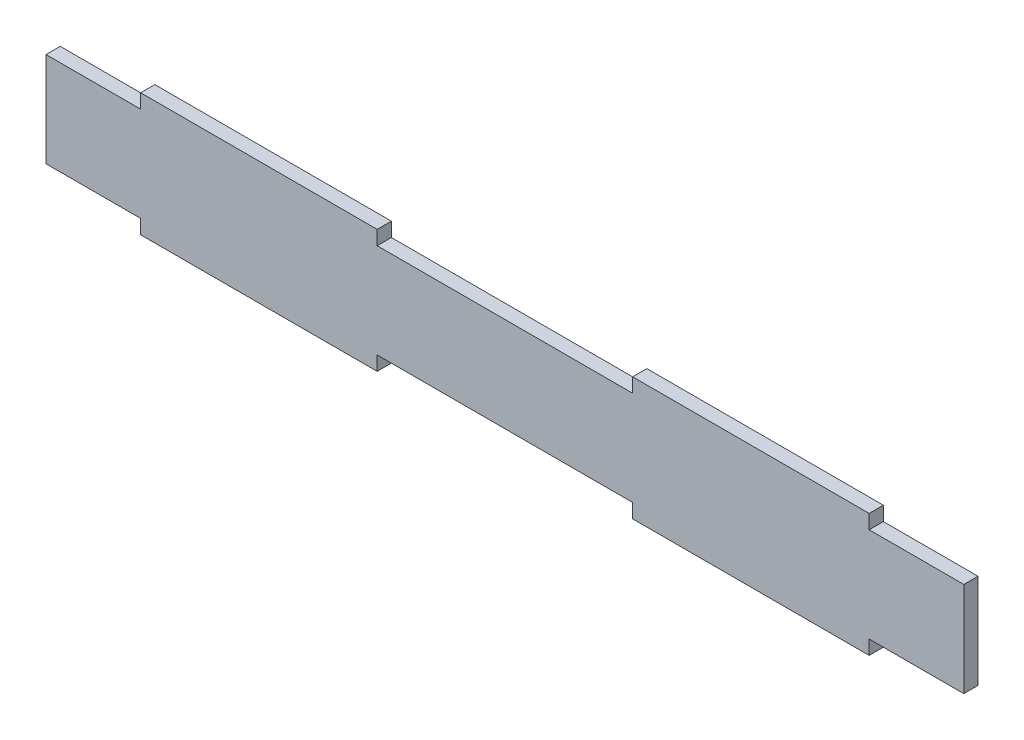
ISO-10303-21;
HEADER;
FILE_DESCRIPTION(('STEP AP214'),'2;1');
FILE_NAME('part.step','',(''),(''),'','','');
FILE_SCHEMA(('AUTOMOTIVE_DESIGN { 1 0 10303 214 1 1 1 1 }'));
ENDSEC;
DATA;
#1=APPLICATION_CONTEXT('core data for automotive mechanical design processes');
#2=APPLICATION_PROTOCOL_DEFINITION('international standard','automotive_design',2000,#1);
#3=PRODUCT_CONTEXT('',#1,'mechanical');
#4=PRODUCT('Part','Part','',(#3));
#5=PRODUCT_RELATED_PRODUCT_CATEGORY('part','',(#4));
#6=PRODUCT_DEFINITION_FORMATION('','',#4);
#7=PRODUCT_DEFINITION_CONTEXT('part definition',#1,'design');
#8=PRODUCT_DEFINITION('design','',#6,#7);
#9=PRODUCT_DEFINITION_SHAPE('','',#8);
#10=(LENGTH_UNIT() NAMED_UNIT(*) SI_UNIT(.MILLI.,.METRE.));
#11=(NAMED_UNIT(*) PLANE_ANGLE_UNIT() SI_UNIT($,.RADIAN.));
#12=(NAMED_UNIT(*) SI_UNIT($,.STERADIAN.) SOLID_ANGLE_UNIT());
#13=UNCERTAINTY_MEASURE_WITH_UNIT(LENGTH_MEASURE(1.E-05),#10,'distance_accuracy_value','');
#14=(GEOMETRIC_REPRESENTATION_CONTEXT(3) GLOBAL_UNCERTAINTY_ASSIGNED_CONTEXT((#13)) GLOBAL_UNIT_ASSIGNED_CONTEXT((#10,
#11,#12)) REPRESENTATION_CONTEXT('',''));
#15=CARTESIAN_POINT('',(0.,0.,0.));
#16=DIRECTION('',(0.,0.,1.));
#17=DIRECTION('',(1.,0.,0.));
#18=AXIS2_PLACEMENT_3D('',#15,#16,#17);
#19=CARTESIAN_POINT('',(0.,0.,3.));
#20=DIRECTION('',(-1.,0.,0.));
#21=DIRECTION('',(0.,0.,1.));
#22=AXIS2_PLACEMENT_3D('',#19,#20,#21);
#23=PLANE('',#22);
#24=DIRECTION('',(0.,1.,0.));
#25=VECTOR('',#24,1.);
#26=CARTESIAN_POINT('',(0.,0.,0.));
#27=LINE('',#26,#25);
#28=CARTESIAN_POINT('',(0.,0.,0.));
#29=VERTEX_POINT('',#28);
#30=CARTESIAN_POINT('',(0.,20.,0.));
#31=VERTEX_POINT('',#30);
#32=EDGE_CURVE('E249',#29,#31,#27,.T.);
#33=ORIENTED_EDGE('',*,*,#32,.F.);
#34=DIRECTION('',(0.,0.,-1.));
#35=VECTOR('',#34,1.);
#36=CARTESIAN_POINT('',(0.,0.,3.));
#37=LINE('',#36,#35);
#38=CARTESIAN_POINT('',(0.,0.,3.));
#39=VERTEX_POINT('',#38);
#40=EDGE_CURVE('E261',#39,#29,#37,.T.);
#41=ORIENTED_EDGE('',*,*,#40,.F.);
#42=DIRECTION('',(0.,1.,0.));
#43=VECTOR('',#42,1.);
#44=CARTESIAN_POINT('',(0.,0.,3.));
#45=LINE('',#44,#43);
#46=CARTESIAN_POINT('',(0.,20.,3.));
#47=VERTEX_POINT('',#46);
#48=EDGE_CURVE('E257',#39,#47,#45,.T.);
#49=ORIENTED_EDGE('',*,*,#48,.T.);
#50=DIRECTION('',(0.,0.,-1.));
#51=VECTOR('',#50,1.);
#52=CARTESIAN_POINT('',(0.,20.,3.));
#53=LINE('',#52,#51);
#54=EDGE_CURVE('E279',#47,#31,#53,.T.);
#55=ORIENTED_EDGE('',*,*,#54,.T.);
#56=EDGE_LOOP('',(#33,#41,#49,#55));
#57=FACE_BOUND('',#56,.T.);
#58=ADVANCED_FACE('F82',(#57),#23,.T.);
#59=CARTESIAN_POINT('',(194.,0.,3.));
#60=DIRECTION('',(-1.,0.,0.));
#61=DIRECTION('',(0.,0.,1.));
#62=AXIS2_PLACEMENT_3D('',#59,#60,#61);
#63=PLANE('',#62);
#64=DIRECTION('',(0.,1.,0.));
#65=VECTOR('',#64,1.);
#66=CARTESIAN_POINT('',(194.,0.,0.));
#67=LINE('',#66,#65);
#68=CARTESIAN_POINT('',(194.,0.,0.));
#69=VERTEX_POINT('',#68);
#70=CARTESIAN_POINT('',(194.,20.,0.));
#71=VERTEX_POINT('',#70);
#72=EDGE_CURVE('E265',#69,#71,#67,.T.);
#73=ORIENTED_EDGE('',*,*,#72,.T.);
#74=DIRECTION('',(0.,0.,-1.));
#75=VECTOR('',#74,1.);
#76=CARTESIAN_POINT('',(194.,20.,3.));
#77=LINE('',#76,#75);
#78=CARTESIAN_POINT('',(194.,20.,3.));
#79=VERTEX_POINT('',#78);
#80=EDGE_CURVE('E282',#79,#71,#77,.T.);
#81=ORIENTED_EDGE('',*,*,#80,.F.);
#82=DIRECTION('',(0.,1.,0.));
#83=VECTOR('',#82,1.);
#84=CARTESIAN_POINT('',(194.,0.,3.));
#85=LINE('',#84,#83);
#86=CARTESIAN_POINT('',(194.,0.,3.));
#87=VERTEX_POINT('',#86);
#88=EDGE_CURVE('E247',#87,#79,#85,.T.);
#89=ORIENTED_EDGE('',*,*,#88,.F.);
#90=DIRECTION('',(0.,0.,-1.));
#91=VECTOR('',#90,1.);
#92=CARTESIAN_POINT('',(194.,0.,3.));
#93=LINE('',#92,#91);
#94=EDGE_CURVE('E229',#87,#69,#93,.T.);
#95=ORIENTED_EDGE('',*,*,#94,.T.);
#96=EDGE_LOOP('',(#73,#81,#89,#95));
#97=FACE_BOUND('',#96,.T.);
#98=ADVANCED_FACE('F418',(#97),#63,.F.);
#99=CARTESIAN_POINT('',(0.,0.,0.));
#100=DIRECTION('',(0.,0.,1.));
#101=DIRECTION('',(1.,0.,0.));
#102=AXIS2_PLACEMENT_3D('',#99,#100,#101);
#103=PLANE('',#102);
#104=DIRECTION('',(1.,0.,0.));
#105=VECTOR('',#104,1.);
#106=CARTESIAN_POINT('',(0.,0.,0.));
#107=LINE('',#106,#105);
#108=CARTESIAN_POINT('',(20.,0.,0.));
#109=VERTEX_POINT('',#108);
#110=EDGE_CURVE('E262',#29,#109,#107,.T.);
#111=ORIENTED_EDGE('',*,*,#110,.F.);
#112=ORIENTED_EDGE('',*,*,#32,.T.);
#113=DIRECTION('',(1.,0.,0.));
#114=VECTOR('',#113,1.);
#115=CARTESIAN_POINT('',(0.,20.,0.));
#116=LINE('',#115,#114);
#117=CARTESIAN_POINT('',(20.,20.,0.));
#118=VERTEX_POINT('',#117);
#119=EDGE_CURVE('E271',#31,#118,#116,.T.);
#120=ORIENTED_EDGE('',*,*,#119,.T.);
#121=DIRECTION('',(0.,1.,0.));
#122=VECTOR('',#121,1.);
#123=CARTESIAN_POINT('',(20.,20.,0.));
#124=LINE('',#123,#122);
#125=CARTESIAN_POINT('',(20.,23.,0.));
#126=VERTEX_POINT('',#125);
#127=EDGE_CURVE('E204',#118,#126,#124,.T.);
#128=ORIENTED_EDGE('',*,*,#127,.T.);
#129=DIRECTION('',(1.,0.,0.));
#130=VECTOR('',#129,1.);
#131=CARTESIAN_POINT('',(20.,23.,0.));
#132=LINE('',#131,#130);
#133=CARTESIAN_POINT('',(70.,23.,0.));
#134=VERTEX_POINT('',#133);
#135=EDGE_CURVE('E299',#126,#134,#132,.T.);
#136=ORIENTED_EDGE('',*,*,#135,.T.);
#137=DIRECTION('',(0.,1.,0.));
#138=VECTOR('',#137,1.);
#139=CARTESIAN_POINT('',(70.,20.,0.));
#140=LINE('',#139,#138);
#141=CARTESIAN_POINT('',(70.,20.,0.));
#142=VERTEX_POINT('',#141);
#143=EDGE_CURVE('E291',#142,#134,#140,.T.);
#144=ORIENTED_EDGE('',*,*,#143,.F.);
#145=CARTESIAN_POINT('',(124.,20.,0.));
#146=VERTEX_POINT('',#145);
#147=EDGE_CURVE('E274',#142,#146,#116,.T.);
#148=ORIENTED_EDGE('',*,*,#147,.T.);
#149=DIRECTION('',(0.,1.,0.));
#150=VECTOR('',#149,1.);
#151=CARTESIAN_POINT('',(124.,20.,0.));
#152=LINE('',#151,#150);
#153=CARTESIAN_POINT('',(124.,23.,0.));
#154=VERTEX_POINT('',#153);
#155=EDGE_CURVE('E209',#146,#154,#152,.T.);
#156=ORIENTED_EDGE('',*,*,#155,.T.);
#157=DIRECTION('',(-1.,0.,0.));
#158=VECTOR('',#157,1.);
#159=CARTESIAN_POINT('',(174.,23.,0.));
#160=LINE('',#159,#158);
#161=CARTESIAN_POINT('',(174.,23.,0.));
#162=VERTEX_POINT('',#161);
#163=EDGE_CURVE('E217',#162,#154,#160,.T.);
#164=ORIENTED_EDGE('',*,*,#163,.F.);
#165=DIRECTION('',(0.,1.,0.));
#166=VECTOR('',#165,1.);
#167=CARTESIAN_POINT('',(174.,20.,0.));
#168=LINE('',#167,#166);
#169=CARTESIAN_POINT('',(174.,20.,0.));
#170=VERTEX_POINT('',#169);
#171=EDGE_CURVE('E167',#170,#162,#168,.T.);
#172=ORIENTED_EDGE('',*,*,#171,.F.);
#173=EDGE_CURVE('E270',#170,#71,#116,.T.);
#174=ORIENTED_EDGE('',*,*,#173,.T.);
#175=ORIENTED_EDGE('',*,*,#72,.F.);
#176=CARTESIAN_POINT('',(174.,0.,0.));
#177=VERTEX_POINT('',#176);
#178=EDGE_CURVE('E267',#177,#69,#107,.T.);
#179=ORIENTED_EDGE('',*,*,#178,.F.);
#180=DIRECTION('',(0.,-1.,0.));
#181=VECTOR('',#180,1.);
#182=CARTESIAN_POINT('',(174.,0.,0.));
#183=LINE('',#182,#181);
#184=CARTESIAN_POINT('',(174.,-3.,0.));
#185=VERTEX_POINT('',#184);
#186=EDGE_CURVE('E182',#177,#185,#183,.T.);
#187=ORIENTED_EDGE('',*,*,#186,.T.);
#188=DIRECTION('',(-1.,0.,0.));
#189=VECTOR('',#188,1.);
#190=CARTESIAN_POINT('',(174.,-3.,0.));
#191=LINE('',#190,#189);
#192=CARTESIAN_POINT('',(124.,-3.,0.));
#193=VERTEX_POINT('',#192);
#194=EDGE_CURVE('E161',#185,#193,#191,.T.);
#195=ORIENTED_EDGE('',*,*,#194,.T.);
#196=DIRECTION('',(0.,-1.,0.));
#197=VECTOR('',#196,1.);
#198=CARTESIAN_POINT('',(124.,0.,0.));
#199=LINE('',#198,#197);
#200=CARTESIAN_POINT('',(124.,0.,0.));
#201=VERTEX_POINT('',#200);
#202=EDGE_CURVE('E170',#201,#193,#199,.T.);
#203=ORIENTED_EDGE('',*,*,#202,.F.);
#204=CARTESIAN_POINT('',(69.9999999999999,0.,0.));
#205=VERTEX_POINT('',#204);
#206=EDGE_CURVE('E266',#205,#201,#107,.T.);
#207=ORIENTED_EDGE('',*,*,#206,.F.);
#208=DIRECTION('',(0.,-1.,0.));
#209=VECTOR('',#208,1.);
#210=CARTESIAN_POINT('',(70.,0.,0.));
#211=LINE('',#210,#209);
#212=CARTESIAN_POINT('',(70.,-3.,0.));
#213=VERTEX_POINT('',#212);
#214=EDGE_CURVE('E315',#205,#213,#211,.T.);
#215=ORIENTED_EDGE('',*,*,#214,.T.);
#216=DIRECTION('',(1.,0.,0.));
#217=VECTOR('',#216,1.);
#218=CARTESIAN_POINT('',(20.,-3.,0.));
#219=LINE('',#218,#217);
#220=CARTESIAN_POINT('',(20.,-3.,0.));
#221=VERTEX_POINT('',#220);
#222=EDGE_CURVE('E320',#221,#213,#219,.T.);
#223=ORIENTED_EDGE('',*,*,#222,.F.);
#224=DIRECTION('',(0.,-1.,0.));
#225=VECTOR('',#224,1.);
#226=CARTESIAN_POINT('',(20.,0.,0.));
#227=LINE('',#226,#225);
#228=EDGE_CURVE('E234',#109,#221,#227,.T.);
#229=ORIENTED_EDGE('',*,*,#228,.F.);
#230=EDGE_LOOP('',(#111,#112,#120,#128,#136,#144,#148,#156,#164,#172,#174,#175,#179,#187,#195,
#203,#207,#215,#223,#229));
#231=FACE_BOUND('',#230,.T.);
#232=ADVANCED_FACE('F180',(#231),#103,.F.);
#233=CARTESIAN_POINT('',(0.,0.,3.));
#234=DIRECTION('',(0.,0.,1.));
#235=DIRECTION('',(1.,0.,0.));
#236=AXIS2_PLACEMENT_3D('',#233,#234,#235);
#237=PLANE('',#236);
#238=DIRECTION('',(1.,0.,0.));
#239=VECTOR('',#238,1.);
#240=CARTESIAN_POINT('',(0.,0.,3.));
#241=LINE('',#240,#239);
#242=CARTESIAN_POINT('',(20.,0.,3.));
#243=VERTEX_POINT('',#242);
#244=EDGE_CURVE('E244',#39,#243,#241,.T.);
#245=ORIENTED_EDGE('',*,*,#244,.T.);
#246=DIRECTION('',(0.,-1.,0.));
#247=VECTOR('',#246,1.);
#248=CARTESIAN_POINT('',(20.,0.,3.));
#249=LINE('',#248,#247);
#250=CARTESIAN_POINT('',(20.,-3.,3.));
#251=VERTEX_POINT('',#250);
#252=EDGE_CURVE('E311',#243,#251,#249,.T.);
#253=ORIENTED_EDGE('',*,*,#252,.T.);
#254=DIRECTION('',(1.,0.,0.));
#255=VECTOR('',#254,1.);
#256=CARTESIAN_POINT('',(20.,-3.,3.));
#257=LINE('',#256,#255);
#258=CARTESIAN_POINT('',(70.,-3.,3.));
#259=VERTEX_POINT('',#258);
#260=EDGE_CURVE('E314',#251,#259,#257,.T.);
#261=ORIENTED_EDGE('',*,*,#260,.T.);
#262=DIRECTION('',(0.,-1.,0.));
#263=VECTOR('',#262,1.);
#264=CARTESIAN_POINT('',(70.,0.,3.));
#265=LINE('',#264,#263);
#266=CARTESIAN_POINT('',(69.9999999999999,0.,3.));
#267=VERTEX_POINT('',#266);
#268=EDGE_CURVE('E201',#267,#259,#265,.T.);
#269=ORIENTED_EDGE('',*,*,#268,.F.);
#270=CARTESIAN_POINT('',(124.,0.,3.));
#271=VERTEX_POINT('',#270);
#272=EDGE_CURVE('E242',#267,#271,#241,.T.);
#273=ORIENTED_EDGE('',*,*,#272,.T.);
#274=DIRECTION('',(0.,-1.,0.));
#275=VECTOR('',#274,1.);
#276=CARTESIAN_POINT('',(124.,0.,3.));
#277=LINE('',#276,#275);
#278=CARTESIAN_POINT('',(124.,-3.,3.));
#279=VERTEX_POINT('',#278);
#280=EDGE_CURVE('E236',#271,#279,#277,.T.);
#281=ORIENTED_EDGE('',*,*,#280,.T.);
#282=DIRECTION('',(-1.,0.,0.));
#283=VECTOR('',#282,1.);
#284=CARTESIAN_POINT('',(174.,-3.,3.));
#285=LINE('',#284,#283);
#286=CARTESIAN_POINT('',(174.,-3.,3.));
#287=VERTEX_POINT('',#286);
#288=EDGE_CURVE('E164',#287,#279,#285,.T.);
#289=ORIENTED_EDGE('',*,*,#288,.F.);
#290=DIRECTION('',(0.,-1.,0.));
#291=VECTOR('',#290,1.);
#292=CARTESIAN_POINT('',(174.,0.,3.));
#293=LINE('',#292,#291);
#294=CARTESIAN_POINT('',(174.,0.,3.));
#295=VERTEX_POINT('',#294);
#296=EDGE_CURVE('E177',#295,#287,#293,.T.);
#297=ORIENTED_EDGE('',*,*,#296,.F.);
#298=EDGE_CURVE('E245',#295,#87,#241,.T.);
#299=ORIENTED_EDGE('',*,*,#298,.T.);
#300=ORIENTED_EDGE('',*,*,#88,.T.);
#301=DIRECTION('',(1.,0.,0.));
#302=VECTOR('',#301,1.);
#303=CARTESIAN_POINT('',(0.,20.,3.));
#304=LINE('',#303,#302);
#305=CARTESIAN_POINT('',(174.,20.,3.));
#306=VERTEX_POINT('',#305);
#307=EDGE_CURVE('E253',#306,#79,#304,.T.);
#308=ORIENTED_EDGE('',*,*,#307,.F.);
#309=DIRECTION('',(0.,1.,0.));
#310=VECTOR('',#309,1.);
#311=CARTESIAN_POINT('',(174.,20.,3.));
#312=LINE('',#311,#310);
#313=CARTESIAN_POINT('',(174.,23.,3.));
#314=VERTEX_POINT('',#313);
#315=EDGE_CURVE('E205',#306,#314,#312,.T.);
#316=ORIENTED_EDGE('',*,*,#315,.T.);
#317=DIRECTION('',(-1.,0.,0.));
#318=VECTOR('',#317,1.);
#319=CARTESIAN_POINT('',(174.,23.,3.));
#320=LINE('',#319,#318);
#321=CARTESIAN_POINT('',(124.,23.,3.));
#322=VERTEX_POINT('',#321);
#323=EDGE_CURVE('E208',#314,#322,#320,.T.);
#324=ORIENTED_EDGE('',*,*,#323,.T.);
#325=DIRECTION('',(0.,1.,0.));
#326=VECTOR('',#325,1.);
#327=CARTESIAN_POINT('',(124.,20.,3.));
#328=LINE('',#327,#326);
#329=CARTESIAN_POINT('',(124.,20.,3.));
#330=VERTEX_POINT('',#329);
#331=EDGE_CURVE('E211',#330,#322,#328,.T.);
#332=ORIENTED_EDGE('',*,*,#331,.F.);
#333=CARTESIAN_POINT('',(70.,20.,3.));
#334=VERTEX_POINT('',#333);
#335=EDGE_CURVE('E258',#334,#330,#304,.T.);
#336=ORIENTED_EDGE('',*,*,#335,.F.);
#337=DIRECTION('',(0.,1.,0.));
#338=VECTOR('',#337,1.);
#339=CARTESIAN_POINT('',(70.,20.,3.));
#340=LINE('',#339,#338);
#341=CARTESIAN_POINT('',(70.,23.,3.));
#342=VERTEX_POINT('',#341);
#343=EDGE_CURVE('E294',#334,#342,#340,.T.);
#344=ORIENTED_EDGE('',*,*,#343,.T.);
#345=DIRECTION('',(1.,0.,0.));
#346=VECTOR('',#345,1.);
#347=CARTESIAN_POINT('',(20.,23.,3.));
#348=LINE('',#347,#346);
#349=CARTESIAN_POINT('',(20.,23.,3.));
#350=VERTEX_POINT('',#349);
#351=EDGE_CURVE('E290',#350,#342,#348,.T.);
#352=ORIENTED_EDGE('',*,*,#351,.F.);
#353=DIRECTION('',(0.,1.,0.));
#354=VECTOR('',#353,1.);
#355=CARTESIAN_POINT('',(20.,20.,3.));
#356=LINE('',#355,#354);
#357=CARTESIAN_POINT('',(20.,20.,3.));
#358=VERTEX_POINT('',#357);
#359=EDGE_CURVE('E287',#358,#350,#356,.T.);
#360=ORIENTED_EDGE('',*,*,#359,.F.);
#361=EDGE_CURVE('E254',#47,#358,#304,.T.);
#362=ORIENTED_EDGE('',*,*,#361,.F.);
#363=ORIENTED_EDGE('',*,*,#48,.F.);
#364=EDGE_LOOP('',(#245,#253,#261,#269,#273,#281,#289,#297,#299,#300,#308,#316,#324,#332,#336,
#344,#352,#360,#362,#363));
#365=FACE_BOUND('',#364,.T.);
#366=ADVANCED_FACE('F240',(#365),#237,.T.);
#367=CARTESIAN_POINT('',(0.,20.,3.));
#368=DIRECTION('',(0.,1.,0.));
#369=DIRECTION('',(0.,0.,1.));
#370=AXIS2_PLACEMENT_3D('',#367,#368,#369);
#371=PLANE('',#370);
#372=DIRECTION('',(0.,0.,-1.));
#373=VECTOR('',#372,1.);
#374=CARTESIAN_POINT('',(70.,20.,3.));
#375=LINE('',#374,#373);
#376=EDGE_CURVE('E188',#334,#142,#375,.T.);
#377=ORIENTED_EDGE('',*,*,#376,.F.);
#378=ORIENTED_EDGE('',*,*,#335,.T.);
#379=DIRECTION('',(0.,0.,-1.));
#380=VECTOR('',#379,1.);
#381=CARTESIAN_POINT('',(124.,20.,3.));
#382=LINE('',#381,#380);
#383=EDGE_CURVE('E226',#330,#146,#382,.T.);
#384=ORIENTED_EDGE('',*,*,#383,.T.);
#385=ORIENTED_EDGE('',*,*,#147,.F.);
#386=EDGE_LOOP('',(#377,#378,#384,#385));
#387=FACE_BOUND('',#386,.T.);
#388=ADVANCED_FACE('F404',(#387),#371,.T.);
#389=DIRECTION('',(0.,0.,-1.));
#390=VECTOR('',#389,1.);
#391=CARTESIAN_POINT('',(174.,20.,3.));
#392=LINE('',#391,#390);
#393=EDGE_CURVE('E222',#306,#170,#392,.T.);
#394=ORIENTED_EDGE('',*,*,#393,.F.);
#395=ORIENTED_EDGE('',*,*,#307,.T.);
#396=ORIENTED_EDGE('',*,*,#80,.T.);
#397=ORIENTED_EDGE('',*,*,#173,.F.);
#398=EDGE_LOOP('',(#394,#395,#396,#397));
#399=FACE_BOUND('',#398,.T.);
#400=ADVANCED_FACE('F393',(#399),#371,.T.);
#401=ORIENTED_EDGE('',*,*,#361,.T.);
#402=DIRECTION('',(0.,0.,-1.));
#403=VECTOR('',#402,1.);
#404=CARTESIAN_POINT('',(20.,20.,3.));
#405=LINE('',#404,#403);
#406=EDGE_CURVE('E225',#358,#118,#405,.T.);
#407=ORIENTED_EDGE('',*,*,#406,.T.);
#408=ORIENTED_EDGE('',*,*,#119,.F.);
#409=ORIENTED_EDGE('',*,*,#54,.F.);
#410=EDGE_LOOP('',(#401,#407,#408,#409));
#411=FACE_BOUND('',#410,.T.);
#412=ADVANCED_FACE('F446',(#411),#371,.T.);
#413=CARTESIAN_POINT('',(0.,0.,3.));
#414=DIRECTION('',(0.,1.,0.));
#415=DIRECTION('',(0.,0.,1.));
#416=AXIS2_PLACEMENT_3D('',#413,#414,#415);
#417=PLANE('',#416);
#418=ORIENTED_EDGE('',*,*,#298,.F.);
#419=DIRECTION('',(0.,0.,-1.));
#420=VECTOR('',#419,1.);
#421=CARTESIAN_POINT('',(174.,0.,3.));
#422=LINE('',#421,#420);
#423=EDGE_CURVE('E101',#295,#177,#422,.T.);
#424=ORIENTED_EDGE('',*,*,#423,.T.);
#425=ORIENTED_EDGE('',*,*,#178,.T.);
#426=ORIENTED_EDGE('',*,*,#94,.F.);
#427=EDGE_LOOP('',(#418,#424,#425,#426));
#428=FACE_BOUND('',#427,.T.);
#429=ADVANCED_FACE('F422',(#428),#417,.F.);
#430=ORIENTED_EDGE('',*,*,#272,.F.);
#431=DIRECTION('',(0.,0.,-1.));
#432=VECTOR('',#431,1.);
#433=CARTESIAN_POINT('',(70.,0.,3.));
#434=LINE('',#433,#432);
#435=EDGE_CURVE('E92',#267,#205,#434,.T.);
#436=ORIENTED_EDGE('',*,*,#435,.T.);
#437=ORIENTED_EDGE('',*,*,#206,.T.);
#438=DIRECTION('',(0.,0.,-1.));
#439=VECTOR('',#438,1.);
#440=CARTESIAN_POINT('',(124.,0.,3.));
#441=LINE('',#440,#439);
#442=EDGE_CURVE('E173',#271,#201,#441,.T.);
#443=ORIENTED_EDGE('',*,*,#442,.F.);
#444=EDGE_LOOP('',(#430,#436,#437,#443));
#445=FACE_BOUND('',#444,.T.);
#446=ADVANCED_FACE('F450',(#445),#417,.F.);
#447=DIRECTION('',(0.,0.,-1.));
#448=VECTOR('',#447,1.);
#449=CARTESIAN_POINT('',(20.,0.,3.));
#450=LINE('',#449,#448);
#451=EDGE_CURVE('E12',#243,#109,#450,.T.);
#452=ORIENTED_EDGE('',*,*,#451,.F.);
#453=ORIENTED_EDGE('',*,*,#244,.F.);
#454=ORIENTED_EDGE('',*,*,#40,.T.);
#455=ORIENTED_EDGE('',*,*,#110,.T.);
#456=EDGE_LOOP('',(#452,#453,#454,#455));
#457=FACE_BOUND('',#456,.T.);
#458=ADVANCED_FACE('F341',(#457),#417,.F.);
#459=CARTESIAN_POINT('',(174.,23.,3.));
#460=DIRECTION('',(0.,-1.,0.));
#461=DIRECTION('',(0.,0.,-1.));
#462=AXIS2_PLACEMENT_3D('',#459,#460,#461);
#463=PLANE('',#462);
#464=ORIENTED_EDGE('',*,*,#163,.T.);
#465=DIRECTION('',(0.,0.,-1.));
#466=VECTOR('',#465,1.);
#467=CARTESIAN_POINT('',(124.,23.,3.));
#468=LINE('',#467,#466);
#469=EDGE_CURVE('E214',#322,#154,#468,.T.);
#470=ORIENTED_EDGE('',*,*,#469,.F.);
#471=ORIENTED_EDGE('',*,*,#323,.F.);
#472=DIRECTION('',(0.,0.,-1.));
#473=VECTOR('',#472,1.);
#474=CARTESIAN_POINT('',(174.,23.,3.));
#475=LINE('',#474,#473);
#476=EDGE_CURVE('E231',#314,#162,#475,.T.);
#477=ORIENTED_EDGE('',*,*,#476,.T.);
#478=EDGE_LOOP('',(#464,#470,#471,#477));
#479=FACE_BOUND('',#478,.T.);
#480=ADVANCED_FACE('F466',(#479),#463,.F.);
#481=CARTESIAN_POINT('',(124.,20.,3.));
#482=DIRECTION('',(-1.,0.,0.));
#483=DIRECTION('',(0.,0.,1.));
#484=AXIS2_PLACEMENT_3D('',#481,#482,#483);
#485=PLANE('',#484);
#486=ORIENTED_EDGE('',*,*,#155,.F.);
#487=ORIENTED_EDGE('',*,*,#383,.F.);
#488=ORIENTED_EDGE('',*,*,#331,.T.);
#489=ORIENTED_EDGE('',*,*,#469,.T.);
#490=EDGE_LOOP('',(#486,#487,#488,#489));
#491=FACE_BOUND('',#490,.T.);
#492=ADVANCED_FACE('F413',(#491),#485,.T.);
#493=CARTESIAN_POINT('',(174.,20.,3.));
#494=DIRECTION('',(-1.,0.,0.));
#495=DIRECTION('',(0.,0.,1.));
#496=AXIS2_PLACEMENT_3D('',#493,#494,#495);
#497=PLANE('',#496);
#498=ORIENTED_EDGE('',*,*,#171,.T.);
#499=ORIENTED_EDGE('',*,*,#476,.F.);
#500=ORIENTED_EDGE('',*,*,#315,.F.);
#501=ORIENTED_EDGE('',*,*,#393,.T.);
#502=EDGE_LOOP('',(#498,#499,#500,#501));
#503=FACE_BOUND('',#502,.T.);
#504=ADVANCED_FACE('F398',(#503),#497,.F.);
#505=CARTESIAN_POINT('',(20.,23.,3.));
#506=DIRECTION('',(0.,1.,0.));
#507=DIRECTION('',(0.,0.,1.));
#508=AXIS2_PLACEMENT_3D('',#505,#506,#507);
#509=PLANE('',#508);
#510=ORIENTED_EDGE('',*,*,#135,.F.);
#511=DIRECTION('',(0.,0.,-1.));
#512=VECTOR('',#511,1.);
#513=CARTESIAN_POINT('',(20.,23.,3.));
#514=LINE('',#513,#512);
#515=EDGE_CURVE('E296',#350,#126,#514,.T.);
#516=ORIENTED_EDGE('',*,*,#515,.F.);
#517=ORIENTED_EDGE('',*,*,#351,.T.);
#518=DIRECTION('',(0.,0.,-1.));
#519=VECTOR('',#518,1.);
#520=CARTESIAN_POINT('',(70.,23.,3.));
#521=LINE('',#520,#519);
#522=EDGE_CURVE('E308',#342,#134,#521,.T.);
#523=ORIENTED_EDGE('',*,*,#522,.T.);
#524=EDGE_LOOP('',(#510,#516,#517,#523));
#525=FACE_BOUND('',#524,.T.);
#526=ADVANCED_FACE('F424',(#525),#509,.T.);
#527=CARTESIAN_POINT('',(20.,20.,3.));
#528=DIRECTION('',(-1.,0.,0.));
#529=DIRECTION('',(0.,0.,1.));
#530=AXIS2_PLACEMENT_3D('',#527,#528,#529);
#531=PLANE('',#530);
#532=ORIENTED_EDGE('',*,*,#127,.F.);
#533=ORIENTED_EDGE('',*,*,#406,.F.);
#534=ORIENTED_EDGE('',*,*,#359,.T.);
#535=ORIENTED_EDGE('',*,*,#515,.T.);
#536=EDGE_LOOP('',(#532,#533,#534,#535));
#537=FACE_BOUND('',#536,.T.);
#538=ADVANCED_FACE('F433',(#537),#531,.T.);
#539=CARTESIAN_POINT('',(70.,20.,3.));
#540=DIRECTION('',(-1.,0.,0.));
#541=DIRECTION('',(0.,0.,1.));
#542=AXIS2_PLACEMENT_3D('',#539,#540,#541);
#543=PLANE('',#542);
#544=ORIENTED_EDGE('',*,*,#143,.T.);
#545=ORIENTED_EDGE('',*,*,#522,.F.);
#546=ORIENTED_EDGE('',*,*,#343,.F.);
#547=ORIENTED_EDGE('',*,*,#376,.T.);
#548=EDGE_LOOP('',(#544,#545,#546,#547));
#549=FACE_BOUND('',#548,.T.);
#550=ADVANCED_FACE('F431',(#549),#543,.F.);
#551=CARTESIAN_POINT('',(174.,-3.,3.));
#552=DIRECTION('',(0.,-1.,0.));
#553=DIRECTION('',(0.,0.,-1.));
#554=AXIS2_PLACEMENT_3D('',#551,#552,#553);
#555=PLANE('',#554);
#556=ORIENTED_EDGE('',*,*,#194,.F.);
#557=DIRECTION('',(0.,0.,-1.));
#558=VECTOR('',#557,1.);
#559=CARTESIAN_POINT('',(174.,-3.,3.));
#560=LINE('',#559,#558);
#561=EDGE_CURVE('E86',#287,#185,#560,.T.);
#562=ORIENTED_EDGE('',*,*,#561,.F.);
#563=ORIENTED_EDGE('',*,*,#288,.T.);
#564=DIRECTION('',(0.,0.,-1.));
#565=VECTOR('',#564,1.);
#566=CARTESIAN_POINT('',(124.,-3.,3.));
#567=LINE('',#566,#565);
#568=EDGE_CURVE('E157',#279,#193,#567,.T.);
#569=ORIENTED_EDGE('',*,*,#568,.T.);
#570=EDGE_LOOP('',(#556,#562,#563,#569));
#571=FACE_BOUND('',#570,.T.);
#572=ADVANCED_FACE('F159',(#571),#555,.T.);
#573=CARTESIAN_POINT('',(174.,0.,3.));
#574=DIRECTION('',(1.,0.,0.));
#575=DIRECTION('',(0.,0.,-1.));
#576=AXIS2_PLACEMENT_3D('',#573,#574,#575);
#577=PLANE('',#576);
#578=ORIENTED_EDGE('',*,*,#186,.F.);
#579=ORIENTED_EDGE('',*,*,#423,.F.);
#580=ORIENTED_EDGE('',*,*,#296,.T.);
#581=ORIENTED_EDGE('',*,*,#561,.T.);
#582=EDGE_LOOP('',(#578,#579,#580,#581));
#583=FACE_BOUND('',#582,.T.);
#584=ADVANCED_FACE('F84',(#583),#577,.T.);
#585=CARTESIAN_POINT('',(124.,0.,3.));
#586=DIRECTION('',(1.,0.,0.));
#587=DIRECTION('',(0.,0.,-1.));
#588=AXIS2_PLACEMENT_3D('',#585,#586,#587);
#589=PLANE('',#588);
#590=ORIENTED_EDGE('',*,*,#202,.T.);
#591=ORIENTED_EDGE('',*,*,#568,.F.);
#592=ORIENTED_EDGE('',*,*,#280,.F.);
#593=ORIENTED_EDGE('',*,*,#442,.T.);
#594=EDGE_LOOP('',(#590,#591,#592,#593));
#595=FACE_BOUND('',#594,.T.);
#596=ADVANCED_FACE('F171',(#595),#589,.F.);
#597=CARTESIAN_POINT('',(20.,-3.,3.));
#598=DIRECTION('',(0.,1.,0.));
#599=DIRECTION('',(0.,0.,1.));
#600=AXIS2_PLACEMENT_3D('',#597,#598,#599);
#601=PLANE('',#600);
#602=ORIENTED_EDGE('',*,*,#222,.T.);
#603=DIRECTION('',(0.,0.,-1.));
#604=VECTOR('',#603,1.);
#605=CARTESIAN_POINT('',(70.,-3.,3.));
#606=LINE('',#605,#604);
#607=EDGE_CURVE('E198',#259,#213,#606,.T.);
#608=ORIENTED_EDGE('',*,*,#607,.F.);
#609=ORIENTED_EDGE('',*,*,#260,.F.);
#610=DIRECTION('',(0.,0.,-1.));
#611=VECTOR('',#610,1.);
#612=CARTESIAN_POINT('',(20.,-3.,3.));
#613=LINE('',#612,#611);
#614=EDGE_CURVE('E200',#251,#221,#613,.T.);
#615=ORIENTED_EDGE('',*,*,#614,.T.);
#616=EDGE_LOOP('',(#602,#608,#609,#615));
#617=FACE_BOUND('',#616,.T.);
#618=ADVANCED_FACE('F429',(#617),#601,.F.);
#619=CARTESIAN_POINT('',(70.,0.,3.));
#620=DIRECTION('',(1.,0.,0.));
#621=DIRECTION('',(0.,0.,-1.));
#622=AXIS2_PLACEMENT_3D('',#619,#620,#621);
#623=PLANE('',#622);
#624=ORIENTED_EDGE('',*,*,#214,.F.);
#625=ORIENTED_EDGE('',*,*,#435,.F.);
#626=ORIENTED_EDGE('',*,*,#268,.T.);
#627=ORIENTED_EDGE('',*,*,#607,.T.);
#628=EDGE_LOOP('',(#624,#625,#626,#627));
#629=FACE_BOUND('',#628,.T.);
#630=ADVANCED_FACE('F325',(#629),#623,.T.);
#631=CARTESIAN_POINT('',(20.,0.,3.));
#632=DIRECTION('',(1.,0.,0.));
#633=DIRECTION('',(0.,0.,-1.));
#634=AXIS2_PLACEMENT_3D('',#631,#632,#633);
#635=PLANE('',#634);
#636=ORIENTED_EDGE('',*,*,#228,.T.);
#637=ORIENTED_EDGE('',*,*,#614,.F.);
#638=ORIENTED_EDGE('',*,*,#252,.F.);
#639=ORIENTED_EDGE('',*,*,#451,.T.);
#640=EDGE_LOOP('',(#636,#637,#638,#639));
#641=FACE_BOUND('',#640,.T.);
#642=ADVANCED_FACE('F346',(#641),#635,.F.);
#643=CLOSED_SHELL('',(#58,#98,#232,#366,#388,#400,#412,#429,#446,#458,#480,#492,#504,#526,#538,
#550,#572,#584,#596,#618,#630,#642));
#644=MANIFOLD_SOLID_BREP('B2',#643);
#645=ADVANCED_BREP_SHAPE_REPRESENTATION('',(#18,#644),#14);
#646=SHAPE_DEFINITION_REPRESENTATION(#9,#645);
ENDSEC;
END-ISO-10303-21;
